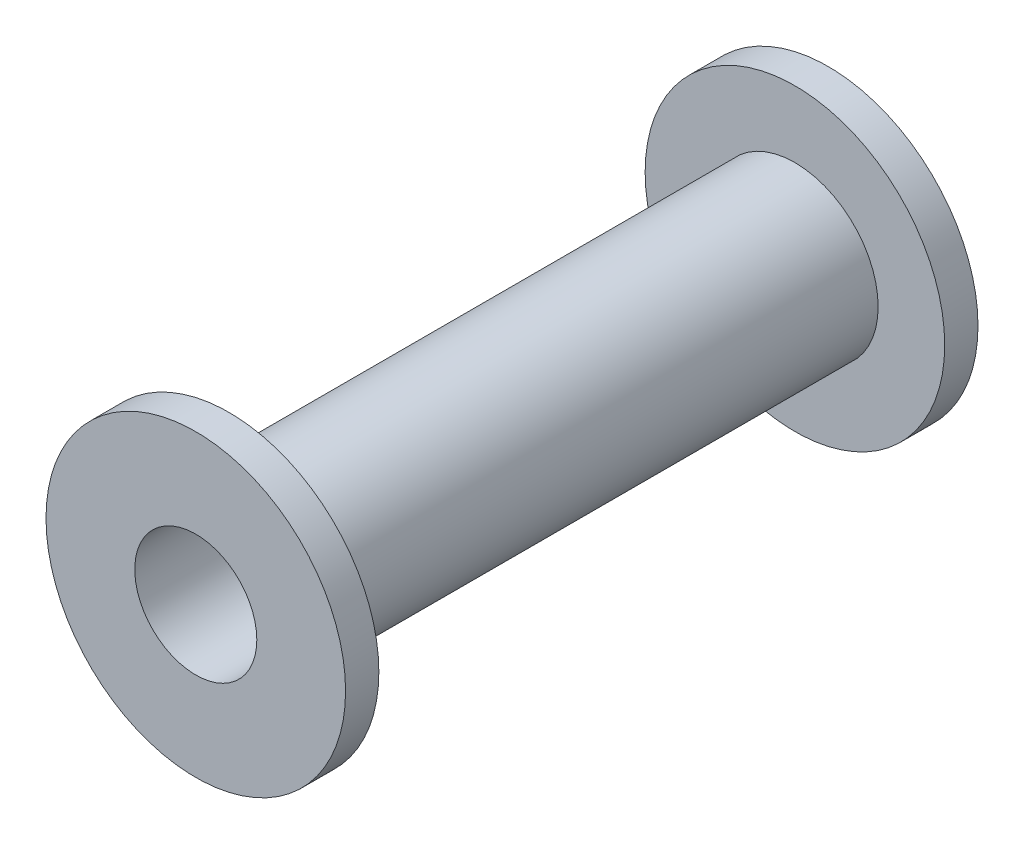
ISO-10303-21;
HEADER;
FILE_DESCRIPTION(('STEP AP214'),'2;1');
FILE_NAME('part.step','',(''),(''),'','','');
FILE_SCHEMA(('AUTOMOTIVE_DESIGN { 1 0 10303 214 1 1 1 1 }'));
ENDSEC;
DATA;
#1=APPLICATION_CONTEXT('core data for automotive mechanical design processes');
#2=APPLICATION_PROTOCOL_DEFINITION('international standard','automotive_design',2000,#1);
#3=PRODUCT_CONTEXT('',#1,'mechanical');
#4=PRODUCT('Part','Part','',(#3));
#5=PRODUCT_RELATED_PRODUCT_CATEGORY('part','',(#4));
#6=PRODUCT_DEFINITION_FORMATION('','',#4);
#7=PRODUCT_DEFINITION_CONTEXT('part definition',#1,'design');
#8=PRODUCT_DEFINITION('design','',#6,#7);
#9=PRODUCT_DEFINITION_SHAPE('','',#8);
#10=(LENGTH_UNIT() NAMED_UNIT(*) SI_UNIT(.MILLI.,.METRE.));
#11=(NAMED_UNIT(*) PLANE_ANGLE_UNIT() SI_UNIT($,.RADIAN.));
#12=(NAMED_UNIT(*) SI_UNIT($,.STERADIAN.) SOLID_ANGLE_UNIT());
#13=UNCERTAINTY_MEASURE_WITH_UNIT(LENGTH_MEASURE(1.E-05),#10,'distance_accuracy_value','');
#14=(GEOMETRIC_REPRESENTATION_CONTEXT(3) GLOBAL_UNCERTAINTY_ASSIGNED_CONTEXT((#13)) GLOBAL_UNIT_ASSIGNED_CONTEXT((#10,
#11,#12)) REPRESENTATION_CONTEXT('',''));
#15=CARTESIAN_POINT('',(0.,0.,0.));
#16=DIRECTION('',(0.,0.,1.));
#17=DIRECTION('',(1.,0.,0.));
#18=AXIS2_PLACEMENT_3D('',#15,#16,#17);
#19=CARTESIAN_POINT('',(0.,0.,3.));
#20=DIRECTION('',(0.,0.,1.));
#21=DIRECTION('',(1.,0.,0.));
#22=AXIS2_PLACEMENT_3D('',#19,#20,#21);
#23=PLANE('',#22);
#24=CARTESIAN_POINT('',(0.,0.,3.));
#25=DIRECTION('',(0.,0.,1.));
#26=DIRECTION('',(1.,0.,0.));
#27=AXIS2_PLACEMENT_3D('',#24,#25,#26);
#28=CIRCLE('',#27,13.5);
#29=CARTESIAN_POINT('',(13.5,0.,3.));
#30=VERTEX_POINT('',#29);
#31=EDGE_CURVE('E10',#30,#30,#28,.T.);
#32=ORIENTED_EDGE('',*,*,#31,.T.);
#33=EDGE_LOOP('',(#32));
#34=FACE_BOUND('',#33,.T.);
#35=CARTESIAN_POINT('',(0.,0.,3.));
#36=DIRECTION('',(0.,0.,1.));
#37=DIRECTION('',(1.,0.,0.));
#38=AXIS2_PLACEMENT_3D('',#35,#36,#37);
#39=CIRCLE('',#38,7.5);
#40=CARTESIAN_POINT('',(7.5,0.,3.));
#41=VERTEX_POINT('',#40);
#42=EDGE_CURVE('E50',#41,#41,#39,.T.);
#43=ORIENTED_EDGE('',*,*,#42,.F.);
#44=EDGE_LOOP('',(#43));
#45=FACE_BOUND('',#44,.T.);
#46=ADVANCED_FACE('F34',(#34,#45),#23,.T.);
#47=CARTESIAN_POINT('',(0.,0.,0.));
#48=DIRECTION('',(0.,0.,1.));
#49=DIRECTION('',(1.,0.,0.));
#50=AXIS2_PLACEMENT_3D('',#47,#48,#49);
#51=PLANE('',#50);
#52=CARTESIAN_POINT('',(0.,0.,0.));
#53=DIRECTION('',(0.,0.,1.));
#54=DIRECTION('',(1.,0.,0.));
#55=AXIS2_PLACEMENT_3D('',#52,#53,#54);
#56=CIRCLE('',#55,13.5);
#57=CARTESIAN_POINT('',(13.5,0.,0.));
#58=VERTEX_POINT('',#57);
#59=EDGE_CURVE('E38',#58,#58,#56,.T.);
#60=ORIENTED_EDGE('',*,*,#59,.F.);
#61=EDGE_LOOP('',(#60));
#62=FACE_BOUND('',#61,.T.);
#63=CARTESIAN_POINT('',(0.,0.,0.));
#64=DIRECTION('',(0.,0.,1.));
#65=DIRECTION('',(1.,0.,0.));
#66=AXIS2_PLACEMENT_3D('',#63,#64,#65);
#67=CIRCLE('',#66,5.5);
#68=CARTESIAN_POINT('',(5.5,0.,0.));
#69=VERTEX_POINT('',#68);
#70=EDGE_CURVE('E45',#69,#69,#67,.T.);
#71=ORIENTED_EDGE('',*,*,#70,.T.);
#72=EDGE_LOOP('',(#71));
#73=FACE_BOUND('',#72,.T.);
#74=ADVANCED_FACE('F83',(#62,#73),#51,.F.);
#75=CARTESIAN_POINT('',(0.,0.,3.));
#76=DIRECTION('',(0.,0.,-1.));
#77=DIRECTION('',(-1.,0.,0.));
#78=AXIS2_PLACEMENT_3D('',#75,#76,#77);
#79=CYLINDRICAL_SURFACE('',#78,13.5);
#80=ORIENTED_EDGE('',*,*,#31,.F.);
#81=EDGE_LOOP('',(#80));
#82=FACE_BOUND('',#81,.T.);
#83=ORIENTED_EDGE('',*,*,#59,.T.);
#84=EDGE_LOOP('',(#83));
#85=FACE_BOUND('',#84,.T.);
#86=ADVANCED_FACE('F36',(#82,#85),#79,.T.);
#87=CARTESIAN_POINT('',(0.,0.,3.));
#88=DIRECTION('',(0.,0.,-1.));
#89=DIRECTION('',(-1.,0.,0.));
#90=AXIS2_PLACEMENT_3D('',#87,#88,#89);
#91=CYLINDRICAL_SURFACE('',#90,5.5);
#92=ORIENTED_EDGE('',*,*,#70,.F.);
#93=EDGE_LOOP('',(#92));
#94=FACE_BOUND('',#93,.T.);
#95=CARTESIAN_POINT('',(0.,0.,57.));
#96=DIRECTION('',(0.,0.,1.));
#97=DIRECTION('',(1.,0.,0.));
#98=AXIS2_PLACEMENT_3D('',#95,#96,#97);
#99=CIRCLE('',#98,5.5);
#100=CARTESIAN_POINT('',(5.5,0.,57.));
#101=VERTEX_POINT('',#100);
#102=EDGE_CURVE('E59',#101,#101,#99,.T.);
#103=ORIENTED_EDGE('',*,*,#102,.T.);
#104=EDGE_LOOP('',(#103));
#105=FACE_BOUND('',#104,.T.);
#106=ADVANCED_FACE('F65',(#94,#105),#91,.F.);
#107=CARTESIAN_POINT('',(0.,0.,54.));
#108=DIRECTION('',(0.,0.,-1.));
#109=DIRECTION('',(-1.,0.,0.));
#110=AXIS2_PLACEMENT_3D('',#107,#108,#109);
#111=CYLINDRICAL_SURFACE('',#110,7.5);
#112=CARTESIAN_POINT('',(0.,0.,54.));
#113=DIRECTION('',(0.,0.,1.));
#114=DIRECTION('',(1.,0.,0.));
#115=AXIS2_PLACEMENT_3D('',#112,#113,#114);
#116=CIRCLE('',#115,7.5);
#117=CARTESIAN_POINT('',(7.5,0.,54.));
#118=VERTEX_POINT('',#117);
#119=EDGE_CURVE('E49',#118,#118,#116,.T.);
#120=ORIENTED_EDGE('',*,*,#119,.F.);
#121=EDGE_LOOP('',(#120));
#122=FACE_BOUND('',#121,.T.);
#123=ORIENTED_EDGE('',*,*,#42,.T.);
#124=EDGE_LOOP('',(#123));
#125=FACE_BOUND('',#124,.T.);
#126=ADVANCED_FACE('F70',(#122,#125),#111,.T.);
#127=CARTESIAN_POINT('',(0.,0.,57.));
#128=DIRECTION('',(0.,0.,1.));
#129=DIRECTION('',(1.,0.,0.));
#130=AXIS2_PLACEMENT_3D('',#127,#128,#129);
#131=PLANE('',#130);
#132=CARTESIAN_POINT('',(0.,0.,57.));
#133=DIRECTION('',(0.,0.,1.));
#134=DIRECTION('',(1.,0.,0.));
#135=AXIS2_PLACEMENT_3D('',#132,#133,#134);
#136=CIRCLE('',#135,13.5);
#137=CARTESIAN_POINT('',(13.5,0.,57.));
#138=VERTEX_POINT('',#137);
#139=EDGE_CURVE('E53',#138,#138,#136,.T.);
#140=ORIENTED_EDGE('',*,*,#139,.T.);
#141=EDGE_LOOP('',(#140));
#142=FACE_BOUND('',#141,.T.);
#143=ORIENTED_EDGE('',*,*,#102,.F.);
#144=EDGE_LOOP('',(#143));
#145=FACE_BOUND('',#144,.T.);
#146=ADVANCED_FACE('F67',(#142,#145),#131,.T.);
#147=CARTESIAN_POINT('',(0.,0.,54.));
#148=DIRECTION('',(0.,0.,1.));
#149=DIRECTION('',(1.,0.,0.));
#150=AXIS2_PLACEMENT_3D('',#147,#148,#149);
#151=PLANE('',#150);
#152=ORIENTED_EDGE('',*,*,#119,.T.);
#153=EDGE_LOOP('',(#152));
#154=FACE_BOUND('',#153,.T.);
#155=CARTESIAN_POINT('',(0.,0.,54.));
#156=DIRECTION('',(0.,0.,1.));
#157=DIRECTION('',(1.,0.,0.));
#158=AXIS2_PLACEMENT_3D('',#155,#156,#157);
#159=CIRCLE('',#158,13.5);
#160=CARTESIAN_POINT('',(13.5,0.,54.));
#161=VERTEX_POINT('',#160);
#162=EDGE_CURVE('E56',#161,#161,#159,.T.);
#163=ORIENTED_EDGE('',*,*,#162,.F.);
#164=EDGE_LOOP('',(#163));
#165=FACE_BOUND('',#164,.T.);
#166=ADVANCED_FACE('F69',(#154,#165),#151,.F.);
#167=CARTESIAN_POINT('',(0.,0.,57.));
#168=DIRECTION('',(0.,0.,-1.));
#169=DIRECTION('',(-1.,0.,0.));
#170=AXIS2_PLACEMENT_3D('',#167,#168,#169);
#171=CYLINDRICAL_SURFACE('',#170,13.5);
#172=ORIENTED_EDGE('',*,*,#139,.F.);
#173=EDGE_LOOP('',(#172));
#174=FACE_BOUND('',#173,.T.);
#175=ORIENTED_EDGE('',*,*,#162,.T.);
#176=EDGE_LOOP('',(#175));
#177=FACE_BOUND('',#176,.T.);
#178=ADVANCED_FACE('F77',(#174,#177),#171,.T.);
#179=CLOSED_SHELL('',(#46,#74,#86,#106,#126,#146,#166,#178));
#180=MANIFOLD_SOLID_BREP('B2',#179);
#181=ADVANCED_BREP_SHAPE_REPRESENTATION('',(#18,#180),#14);
#182=SHAPE_DEFINITION_REPRESENTATION(#9,#181);
ENDSEC;
END-ISO-10303-21;
